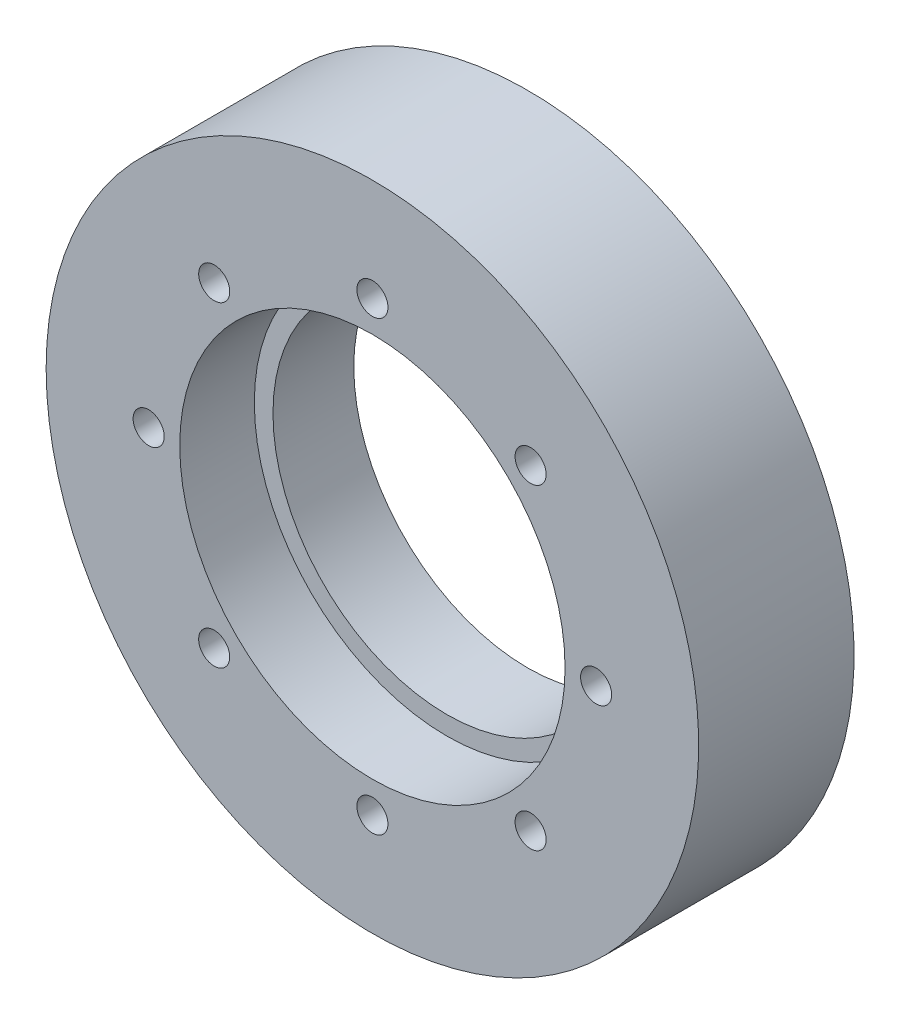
ISO-10303-21;
HEADER;
FILE_DESCRIPTION(('STEP AP214'),'2;1');
FILE_NAME('part.step','',(''),(''),'','','');
FILE_SCHEMA(('AUTOMOTIVE_DESIGN { 1 0 10303 214 1 1 1 1 }'));
ENDSEC;
DATA;
#1=APPLICATION_CONTEXT('core data for automotive mechanical design processes');
#2=APPLICATION_PROTOCOL_DEFINITION('international standard','automotive_design',2000,#1);
#3=PRODUCT_CONTEXT('',#1,'mechanical');
#4=PRODUCT('Part','Part','',(#3));
#5=PRODUCT_RELATED_PRODUCT_CATEGORY('part','',(#4));
#6=PRODUCT_DEFINITION_FORMATION('','',#4);
#7=PRODUCT_DEFINITION_CONTEXT('part definition',#1,'design');
#8=PRODUCT_DEFINITION('design','',#6,#7);
#9=PRODUCT_DEFINITION_SHAPE('','',#8);
#10=(LENGTH_UNIT() NAMED_UNIT(*) SI_UNIT(.MILLI.,.METRE.));
#11=(NAMED_UNIT(*) PLANE_ANGLE_UNIT() SI_UNIT($,.RADIAN.));
#12=(NAMED_UNIT(*) SI_UNIT($,.STERADIAN.) SOLID_ANGLE_UNIT());
#13=UNCERTAINTY_MEASURE_WITH_UNIT(LENGTH_MEASURE(1.E-05),#10,'distance_accuracy_value','');
#14=(GEOMETRIC_REPRESENTATION_CONTEXT(3) GLOBAL_UNCERTAINTY_ASSIGNED_CONTEXT((#13)) GLOBAL_UNIT_ASSIGNED_CONTEXT((#10,
#11,#12)) REPRESENTATION_CONTEXT('',''));
#15=CARTESIAN_POINT('',(0.,0.,0.));
#16=DIRECTION('',(0.,0.,1.));
#17=DIRECTION('',(1.,0.,0.));
#18=AXIS2_PLACEMENT_3D('',#15,#16,#17);
#19=CARTESIAN_POINT('',(0.,0.,17.5));
#20=DIRECTION('',(0.,0.,-1.));
#21=DIRECTION('',(-1.,0.,0.));
#22=AXIS2_PLACEMENT_3D('',#19,#20,#21);
#23=CYLINDRICAL_SURFACE('',#22,31.);
#24=CARTESIAN_POINT('',(0.,0.,12.5));
#25=DIRECTION('',(0.,0.,-1.));
#26=DIRECTION('',(-1.,0.,0.));
#27=AXIS2_PLACEMENT_3D('',#24,#25,#26);
#28=CIRCLE('',#27,31.);
#29=CARTESIAN_POINT('',(-31.,0.,12.5));
#30=VERTEX_POINT('',#29);
#31=EDGE_CURVE('E61',#30,#30,#28,.T.);
#32=ORIENTED_EDGE('',*,*,#31,.F.);
#33=EDGE_LOOP('',(#32));
#34=FACE_BOUND('',#33,.T.);
#35=CARTESIAN_POINT('',(0.,0.,0.499999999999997));
#36=DIRECTION('',(0.,0.,-1.));
#37=DIRECTION('',(-1.,0.,0.));
#38=AXIS2_PLACEMENT_3D('',#35,#36,#37);
#39=CIRCLE('',#38,31.);
#40=CARTESIAN_POINT('',(-31.,0.,0.499999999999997));
#41=VERTEX_POINT('',#40);
#42=EDGE_CURVE('E10',#41,#41,#39,.F.);
#43=ORIENTED_EDGE('',*,*,#42,.F.);
#44=EDGE_LOOP('',(#43));
#45=FACE_BOUND('',#44,.T.);
#46=ADVANCED_FACE('F42',(#34,#45),#23,.F.);
#47=CARTESIAN_POINT('',(0.,0.,-12.5));
#48=DIRECTION('',(0.,0.,-1.));
#49=DIRECTION('',(-1.,0.,0.));
#50=AXIS2_PLACEMENT_3D('',#47,#48,#49);
#51=PLANE('',#50);
#52=CARTESIAN_POINT('',(-36.,0.,-12.5));
#53=DIRECTION('',(0.,0.,-1.));
#54=DIRECTION('',(-1.,0.,0.));
#55=AXIS2_PLACEMENT_3D('',#52,#53,#54);
#56=CIRCLE('',#55,2.5);
#57=CARTESIAN_POINT('',(-38.5,0.,-12.5));
#58=VERTEX_POINT('',#57);
#59=EDGE_CURVE('E74',#58,#58,#56,.T.);
#60=ORIENTED_EDGE('',*,*,#59,.F.);
#61=EDGE_LOOP('',(#60));
#62=FACE_BOUND('',#61,.T.);
#63=CARTESIAN_POINT('',(-25.4558441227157,-25.4558441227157,-12.5));
#64=DIRECTION('',(0.,0.,-1.));
#65=DIRECTION('',(-1.,0.,0.));
#66=AXIS2_PLACEMENT_3D('',#63,#64,#65);
#67=CIRCLE('',#66,2.5);
#68=CARTESIAN_POINT('',(-27.9558441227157,-25.4558441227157,-12.5));
#69=VERTEX_POINT('',#68);
#70=EDGE_CURVE('E161',#69,#69,#67,.T.);
#71=ORIENTED_EDGE('',*,*,#70,.F.);
#72=EDGE_LOOP('',(#71));
#73=FACE_BOUND('',#72,.T.);
#74=CARTESIAN_POINT('',(0.,-36.,-12.5));
#75=DIRECTION('',(0.,0.,-1.));
#76=DIRECTION('',(-1.,0.,0.));
#77=AXIS2_PLACEMENT_3D('',#74,#75,#76);
#78=CIRCLE('',#77,2.5);
#79=CARTESIAN_POINT('',(-2.5,-36.,-12.5));
#80=VERTEX_POINT('',#79);
#81=EDGE_CURVE('E165',#80,#80,#78,.T.);
#82=ORIENTED_EDGE('',*,*,#81,.F.);
#83=EDGE_LOOP('',(#82));
#84=FACE_BOUND('',#83,.T.);
#85=CARTESIAN_POINT('',(25.4558441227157,-25.4558441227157,-12.5));
#86=DIRECTION('',(0.,0.,-1.));
#87=DIRECTION('',(-1.,0.,0.));
#88=AXIS2_PLACEMENT_3D('',#85,#86,#87);
#89=CIRCLE('',#88,2.5);
#90=CARTESIAN_POINT('',(22.9558441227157,-25.4558441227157,-12.5));
#91=VERTEX_POINT('',#90);
#92=EDGE_CURVE('E169',#91,#91,#89,.T.);
#93=ORIENTED_EDGE('',*,*,#92,.F.);
#94=EDGE_LOOP('',(#93));
#95=FACE_BOUND('',#94,.T.);
#96=CARTESIAN_POINT('',(36.,0.,-12.5));
#97=DIRECTION('',(0.,0.,-1.));
#98=DIRECTION('',(-1.,0.,0.));
#99=AXIS2_PLACEMENT_3D('',#96,#97,#98);
#100=CIRCLE('',#99,2.5);
#101=CARTESIAN_POINT('',(33.5,0.,-12.5));
#102=VERTEX_POINT('',#101);
#103=EDGE_CURVE('E173',#102,#102,#100,.T.);
#104=ORIENTED_EDGE('',*,*,#103,.F.);
#105=EDGE_LOOP('',(#104));
#106=FACE_BOUND('',#105,.T.);
#107=CARTESIAN_POINT('',(25.4558441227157,25.4558441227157,-12.5));
#108=DIRECTION('',(0.,0.,-1.));
#109=DIRECTION('',(-1.,0.,0.));
#110=AXIS2_PLACEMENT_3D('',#107,#108,#109);
#111=CIRCLE('',#110,2.5);
#112=CARTESIAN_POINT('',(22.9558441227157,25.4558441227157,-12.5));
#113=VERTEX_POINT('',#112);
#114=EDGE_CURVE('E177',#113,#113,#111,.T.);
#115=ORIENTED_EDGE('',*,*,#114,.F.);
#116=EDGE_LOOP('',(#115));
#117=FACE_BOUND('',#116,.T.);
#118=CARTESIAN_POINT('',(0.,36.,-12.5));
#119=DIRECTION('',(0.,0.,-1.));
#120=DIRECTION('',(-1.,0.,0.));
#121=AXIS2_PLACEMENT_3D('',#118,#119,#120);
#122=CIRCLE('',#121,2.5);
#123=CARTESIAN_POINT('',(-2.5,36.,-12.5));
#124=VERTEX_POINT('',#123);
#125=EDGE_CURVE('E181',#124,#124,#122,.T.);
#126=ORIENTED_EDGE('',*,*,#125,.F.);
#127=EDGE_LOOP('',(#126));
#128=FACE_BOUND('',#127,.T.);
#129=CARTESIAN_POINT('',(-25.4558441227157,25.4558441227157,-12.5));
#130=DIRECTION('',(0.,0.,-1.));
#131=DIRECTION('',(-1.,0.,0.));
#132=AXIS2_PLACEMENT_3D('',#129,#130,#131);
#133=CIRCLE('',#132,2.5);
#134=CARTESIAN_POINT('',(-27.9558441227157,25.4558441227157,-12.5));
#135=VERTEX_POINT('',#134);
#136=EDGE_CURVE('E156',#135,#135,#133,.T.);
#137=ORIENTED_EDGE('',*,*,#136,.F.);
#138=EDGE_LOOP('',(#137));
#139=FACE_BOUND('',#138,.T.);
#140=CARTESIAN_POINT('',(0.,0.,-12.5));
#141=DIRECTION('',(0.,0.,-1.));
#142=DIRECTION('',(-1.,0.,0.));
#143=AXIS2_PLACEMENT_3D('',#140,#141,#142);
#144=CIRCLE('',#143,52.5);
#145=CARTESIAN_POINT('',(-52.5,0.,-12.5));
#146=VERTEX_POINT('',#145);
#147=EDGE_CURVE('E55',#146,#146,#144,.T.);
#148=ORIENTED_EDGE('',*,*,#147,.T.);
#149=EDGE_LOOP('',(#148));
#150=FACE_BOUND('',#149,.T.);
#151=CARTESIAN_POINT('',(0.,0.,-12.5));
#152=DIRECTION('',(0.,0.,-1.));
#153=DIRECTION('',(-1.,0.,0.));
#154=AXIS2_PLACEMENT_3D('',#151,#152,#153);
#155=CIRCLE('',#154,28.);
#156=CARTESIAN_POINT('',(-28.,0.,-12.5));
#157=VERTEX_POINT('',#156);
#158=EDGE_CURVE('E149',#157,#157,#155,.T.);
#159=ORIENTED_EDGE('',*,*,#158,.F.);
#160=EDGE_LOOP('',(#159));
#161=FACE_BOUND('',#160,.T.);
#162=ADVANCED_FACE('F44',(#62,#73,#84,#95,#106,#117,#128,#139,#150,#161),#51,.T.);
#163=CARTESIAN_POINT('',(0.,0.,-12.5));
#164=DIRECTION('',(0.,0.,-1.));
#165=DIRECTION('',(-1.,0.,0.));
#166=AXIS2_PLACEMENT_3D('',#163,#164,#165);
#167=CYLINDRICAL_SURFACE('',#166,52.5);
#168=ORIENTED_EDGE('',*,*,#147,.F.);
#169=EDGE_LOOP('',(#168));
#170=FACE_BOUND('',#169,.T.);
#171=CARTESIAN_POINT('',(0.,0.,12.5));
#172=DIRECTION('',(0.,0.,-1.));
#173=DIRECTION('',(-1.,0.,0.));
#174=AXIS2_PLACEMENT_3D('',#171,#172,#173);
#175=CIRCLE('',#174,52.5);
#176=CARTESIAN_POINT('',(-52.5,0.,12.5));
#177=VERTEX_POINT('',#176);
#178=EDGE_CURVE('E50',#177,#177,#175,.T.);
#179=ORIENTED_EDGE('',*,*,#178,.T.);
#180=EDGE_LOOP('',(#179));
#181=FACE_BOUND('',#180,.T.);
#182=ADVANCED_FACE('F127',(#170,#181),#167,.T.);
#183=CARTESIAN_POINT('',(0.,0.,12.5));
#184=DIRECTION('',(0.,0.,-1.));
#185=DIRECTION('',(-1.,0.,0.));
#186=AXIS2_PLACEMENT_3D('',#183,#184,#185);
#187=PLANE('',#186);
#188=CARTESIAN_POINT('',(-36.,0.,12.5));
#189=DIRECTION('',(0.,0.,-1.));
#190=DIRECTION('',(-1.,0.,0.));
#191=AXIS2_PLACEMENT_3D('',#188,#189,#190);
#192=CIRCLE('',#191,2.5);
#193=CARTESIAN_POINT('',(-38.5,0.,12.5));
#194=VERTEX_POINT('',#193);
#195=EDGE_CURVE('E68',#194,#194,#192,.T.);
#196=ORIENTED_EDGE('',*,*,#195,.T.);
#197=EDGE_LOOP('',(#196));
#198=FACE_BOUND('',#197,.T.);
#199=CARTESIAN_POINT('',(-25.4558441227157,-25.4558441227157,12.5));
#200=DIRECTION('',(0.,0.,-1.));
#201=DIRECTION('',(-1.,0.,0.));
#202=AXIS2_PLACEMENT_3D('',#199,#200,#201);
#203=CIRCLE('',#202,2.5);
#204=CARTESIAN_POINT('',(-27.9558441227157,-25.4558441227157,12.5));
#205=VERTEX_POINT('',#204);
#206=EDGE_CURVE('E94',#205,#205,#203,.T.);
#207=ORIENTED_EDGE('',*,*,#206,.T.);
#208=EDGE_LOOP('',(#207));
#209=FACE_BOUND('',#208,.T.);
#210=CARTESIAN_POINT('',(0.,-36.,12.5));
#211=DIRECTION('',(0.,0.,-1.));
#212=DIRECTION('',(-1.,0.,0.));
#213=AXIS2_PLACEMENT_3D('',#210,#211,#212);
#214=CIRCLE('',#213,2.5);
#215=CARTESIAN_POINT('',(-2.49999999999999,-36.,12.5));
#216=VERTEX_POINT('',#215);
#217=EDGE_CURVE('E90',#216,#216,#214,.T.);
#218=ORIENTED_EDGE('',*,*,#217,.T.);
#219=EDGE_LOOP('',(#218));
#220=FACE_BOUND('',#219,.T.);
#221=CARTESIAN_POINT('',(25.4558441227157,-25.4558441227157,12.5));
#222=DIRECTION('',(0.,0.,-1.));
#223=DIRECTION('',(-1.,0.,0.));
#224=AXIS2_PLACEMENT_3D('',#221,#222,#223);
#225=CIRCLE('',#224,2.5);
#226=CARTESIAN_POINT('',(22.9558441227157,-25.4558441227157,12.5));
#227=VERTEX_POINT('',#226);
#228=EDGE_CURVE('E86',#227,#227,#225,.T.);
#229=ORIENTED_EDGE('',*,*,#228,.T.);
#230=EDGE_LOOP('',(#229));
#231=FACE_BOUND('',#230,.T.);
#232=CARTESIAN_POINT('',(36.,0.,12.5));
#233=DIRECTION('',(0.,0.,-1.));
#234=DIRECTION('',(-1.,0.,0.));
#235=AXIS2_PLACEMENT_3D('',#232,#233,#234);
#236=CIRCLE('',#235,2.5);
#237=CARTESIAN_POINT('',(33.5,0.,12.5));
#238=VERTEX_POINT('',#237);
#239=EDGE_CURVE('E82',#238,#238,#236,.T.);
#240=ORIENTED_EDGE('',*,*,#239,.T.);
#241=EDGE_LOOP('',(#240));
#242=FACE_BOUND('',#241,.T.);
#243=CARTESIAN_POINT('',(25.4558441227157,25.4558441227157,12.5));
#244=DIRECTION('',(0.,0.,-1.));
#245=DIRECTION('',(-1.,0.,0.));
#246=AXIS2_PLACEMENT_3D('',#243,#244,#245);
#247=CIRCLE('',#246,2.5);
#248=CARTESIAN_POINT('',(22.9558441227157,25.4558441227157,12.5));
#249=VERTEX_POINT('',#248);
#250=EDGE_CURVE('E78',#249,#249,#247,.T.);
#251=ORIENTED_EDGE('',*,*,#250,.T.);
#252=EDGE_LOOP('',(#251));
#253=FACE_BOUND('',#252,.T.);
#254=CARTESIAN_POINT('',(0.,36.,12.5));
#255=DIRECTION('',(0.,0.,-1.));
#256=DIRECTION('',(-1.,0.,0.));
#257=AXIS2_PLACEMENT_3D('',#254,#255,#256);
#258=CIRCLE('',#257,2.5);
#259=CARTESIAN_POINT('',(-2.5,36.,12.5));
#260=VERTEX_POINT('',#259);
#261=EDGE_CURVE('E73',#260,#260,#258,.T.);
#262=ORIENTED_EDGE('',*,*,#261,.T.);
#263=EDGE_LOOP('',(#262));
#264=FACE_BOUND('',#263,.T.);
#265=CARTESIAN_POINT('',(-25.4558441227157,25.4558441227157,12.5));
#266=DIRECTION('',(0.,0.,-1.));
#267=DIRECTION('',(-1.,0.,0.));
#268=AXIS2_PLACEMENT_3D('',#265,#266,#267);
#269=CIRCLE('',#268,2.5);
#270=CARTESIAN_POINT('',(-27.9558441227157,25.4558441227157,12.5));
#271=VERTEX_POINT('',#270);
#272=EDGE_CURVE('E69',#271,#271,#269,.T.);
#273=ORIENTED_EDGE('',*,*,#272,.T.);
#274=EDGE_LOOP('',(#273));
#275=FACE_BOUND('',#274,.T.);
#276=ORIENTED_EDGE('',*,*,#31,.T.);
#277=EDGE_LOOP('',(#276));
#278=FACE_BOUND('',#277,.T.);
#279=ORIENTED_EDGE('',*,*,#178,.F.);
#280=EDGE_LOOP('',(#279));
#281=FACE_BOUND('',#280,.T.);
#282=ADVANCED_FACE('F101',(#198,#209,#220,#231,#242,#253,#264,#275,#278,#281),#187,.F.);
#283=CARTESIAN_POINT('',(-25.4558441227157,25.4558441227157,17.5));
#284=DIRECTION('',(0.,0.,-1.));
#285=DIRECTION('',(-1.,0.,0.));
#286=AXIS2_PLACEMENT_3D('',#283,#284,#285);
#287=CYLINDRICAL_SURFACE('',#286,2.5);
#288=ORIENTED_EDGE('',*,*,#136,.T.);
#289=EDGE_LOOP('',(#288));
#290=FACE_BOUND('',#289,.T.);
#291=ORIENTED_EDGE('',*,*,#272,.F.);
#292=EDGE_LOOP('',(#291));
#293=FACE_BOUND('',#292,.T.);
#294=ADVANCED_FACE('F134',(#290,#293),#287,.F.);
#295=CARTESIAN_POINT('',(0.,36.,17.5));
#296=DIRECTION('',(0.,0.,-1.));
#297=DIRECTION('',(-1.,0.,0.));
#298=AXIS2_PLACEMENT_3D('',#295,#296,#297);
#299=CYLINDRICAL_SURFACE('',#298,2.5);
#300=ORIENTED_EDGE('',*,*,#125,.T.);
#301=EDGE_LOOP('',(#300));
#302=FACE_BOUND('',#301,.T.);
#303=ORIENTED_EDGE('',*,*,#261,.F.);
#304=EDGE_LOOP('',(#303));
#305=FACE_BOUND('',#304,.T.);
#306=ADVANCED_FACE('F139',(#302,#305),#299,.F.);
#307=CARTESIAN_POINT('',(25.4558441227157,25.4558441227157,17.5));
#308=DIRECTION('',(0.,0.,-1.));
#309=DIRECTION('',(-1.,0.,0.));
#310=AXIS2_PLACEMENT_3D('',#307,#308,#309);
#311=CYLINDRICAL_SURFACE('',#310,2.5);
#312=ORIENTED_EDGE('',*,*,#114,.T.);
#313=EDGE_LOOP('',(#312));
#314=FACE_BOUND('',#313,.T.);
#315=ORIENTED_EDGE('',*,*,#250,.F.);
#316=EDGE_LOOP('',(#315));
#317=FACE_BOUND('',#316,.T.);
#318=ADVANCED_FACE('F198',(#314,#317),#311,.F.);
#319=CARTESIAN_POINT('',(36.,0.,17.5));
#320=DIRECTION('',(0.,0.,-1.));
#321=DIRECTION('',(-1.,0.,0.));
#322=AXIS2_PLACEMENT_3D('',#319,#320,#321);
#323=CYLINDRICAL_SURFACE('',#322,2.5);
#324=ORIENTED_EDGE('',*,*,#103,.T.);
#325=EDGE_LOOP('',(#324));
#326=FACE_BOUND('',#325,.T.);
#327=ORIENTED_EDGE('',*,*,#239,.F.);
#328=EDGE_LOOP('',(#327));
#329=FACE_BOUND('',#328,.T.);
#330=ADVANCED_FACE('F205',(#326,#329),#323,.F.);
#331=CARTESIAN_POINT('',(25.4558441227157,-25.4558441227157,17.5));
#332=DIRECTION('',(0.,0.,-1.));
#333=DIRECTION('',(-1.,0.,0.));
#334=AXIS2_PLACEMENT_3D('',#331,#332,#333);
#335=CYLINDRICAL_SURFACE('',#334,2.5);
#336=ORIENTED_EDGE('',*,*,#92,.T.);
#337=EDGE_LOOP('',(#336));
#338=FACE_BOUND('',#337,.T.);
#339=ORIENTED_EDGE('',*,*,#228,.F.);
#340=EDGE_LOOP('',(#339));
#341=FACE_BOUND('',#340,.T.);
#342=ADVANCED_FACE('F211',(#338,#341),#335,.F.);
#343=CARTESIAN_POINT('',(0.,-36.,17.5));
#344=DIRECTION('',(0.,0.,-1.));
#345=DIRECTION('',(-1.,0.,0.));
#346=AXIS2_PLACEMENT_3D('',#343,#344,#345);
#347=CYLINDRICAL_SURFACE('',#346,2.5);
#348=ORIENTED_EDGE('',*,*,#81,.T.);
#349=EDGE_LOOP('',(#348));
#350=FACE_BOUND('',#349,.T.);
#351=ORIENTED_EDGE('',*,*,#217,.F.);
#352=EDGE_LOOP('',(#351));
#353=FACE_BOUND('',#352,.T.);
#354=ADVANCED_FACE('F117',(#350,#353),#347,.F.);
#355=CARTESIAN_POINT('',(-25.4558441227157,-25.4558441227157,17.5));
#356=DIRECTION('',(0.,0.,-1.));
#357=DIRECTION('',(-1.,0.,0.));
#358=AXIS2_PLACEMENT_3D('',#355,#356,#357);
#359=CYLINDRICAL_SURFACE('',#358,2.5);
#360=ORIENTED_EDGE('',*,*,#70,.T.);
#361=EDGE_LOOP('',(#360));
#362=FACE_BOUND('',#361,.T.);
#363=ORIENTED_EDGE('',*,*,#206,.F.);
#364=EDGE_LOOP('',(#363));
#365=FACE_BOUND('',#364,.T.);
#366=ADVANCED_FACE('F107',(#362,#365),#359,.F.);
#367=CARTESIAN_POINT('',(-36.,0.,17.5));
#368=DIRECTION('',(0.,0.,-1.));
#369=DIRECTION('',(-1.,0.,0.));
#370=AXIS2_PLACEMENT_3D('',#367,#368,#369);
#371=CYLINDRICAL_SURFACE('',#370,2.5);
#372=ORIENTED_EDGE('',*,*,#59,.T.);
#373=EDGE_LOOP('',(#372));
#374=FACE_BOUND('',#373,.T.);
#375=ORIENTED_EDGE('',*,*,#195,.F.);
#376=EDGE_LOOP('',(#375));
#377=FACE_BOUND('',#376,.T.);
#378=ADVANCED_FACE('F104',(#374,#377),#371,.F.);
#379=CARTESIAN_POINT('',(0.,0.,0.499999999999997));
#380=DIRECTION('',(0.,0.,-1.));
#381=DIRECTION('',(-1.,0.,0.));
#382=AXIS2_PLACEMENT_3D('',#379,#380,#381);
#383=PLANE('',#382);
#384=CARTESIAN_POINT('',(0.,0.,0.499999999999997));
#385=DIRECTION('',(0.,0.,-1.));
#386=DIRECTION('',(-1.,0.,0.));
#387=AXIS2_PLACEMENT_3D('',#384,#385,#386);
#388=CIRCLE('',#387,28.);
#389=CARTESIAN_POINT('',(-28.,0.,0.499999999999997));
#390=VERTEX_POINT('',#389);
#391=EDGE_CURVE('E152',#390,#390,#388,.T.);
#392=ORIENTED_EDGE('',*,*,#391,.T.);
#393=EDGE_LOOP('',(#392));
#394=FACE_BOUND('',#393,.T.);
#395=ORIENTED_EDGE('',*,*,#42,.T.);
#396=EDGE_LOOP('',(#395));
#397=FACE_BOUND('',#396,.T.);
#398=ADVANCED_FACE('F106',(#394,#397),#383,.F.);
#399=CARTESIAN_POINT('',(0.,0.,0.499999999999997));
#400=DIRECTION('',(0.,0.,-1.));
#401=DIRECTION('',(-1.,0.,0.));
#402=AXIS2_PLACEMENT_3D('',#399,#400,#401);
#403=CYLINDRICAL_SURFACE('',#402,28.);
#404=ORIENTED_EDGE('',*,*,#391,.F.);
#405=EDGE_LOOP('',(#404));
#406=FACE_BOUND('',#405,.T.);
#407=ORIENTED_EDGE('',*,*,#158,.T.);
#408=EDGE_LOOP('',(#407));
#409=FACE_BOUND('',#408,.T.);
#410=ADVANCED_FACE('F114',(#406,#409),#403,.F.);
#411=CLOSED_SHELL('',(#46,#162,#182,#282,#294,#306,#318,#330,#342,#354,#366,#378,#398,#410));
#412=MANIFOLD_SOLID_BREP('B2',#411);
#413=ADVANCED_BREP_SHAPE_REPRESENTATION('',(#18,#412),#14);
#414=SHAPE_DEFINITION_REPRESENTATION(#9,#413);
ENDSEC;
END-ISO-10303-21;
